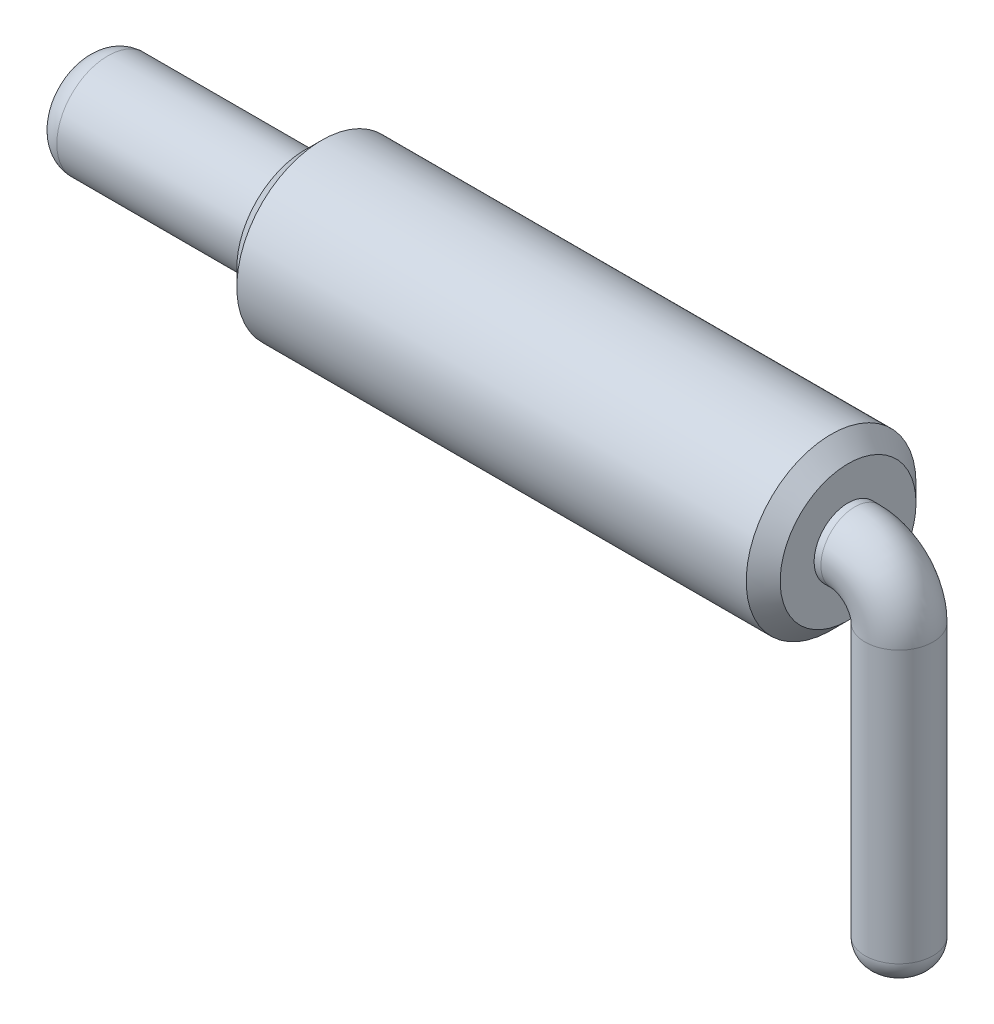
ISO-10303-21;
HEADER;
FILE_DESCRIPTION(('STEP AP214'),'2;1');
FILE_NAME('part.step','',(''),(''),'','','');
FILE_SCHEMA(('AUTOMOTIVE_DESIGN { 1 0 10303 214 1 1 1 1 }'));
ENDSEC;
DATA;
#1=APPLICATION_CONTEXT('core data for automotive mechanical design processes');
#2=APPLICATION_PROTOCOL_DEFINITION('international standard','automotive_design',2000,#1);
#3=PRODUCT_CONTEXT('',#1,'mechanical');
#4=PRODUCT('Part','Part','',(#3));
#5=PRODUCT_RELATED_PRODUCT_CATEGORY('part','',(#4));
#6=PRODUCT_DEFINITION_FORMATION('','',#4);
#7=PRODUCT_DEFINITION_CONTEXT('part definition',#1,'design');
#8=PRODUCT_DEFINITION('design','',#6,#7);
#9=PRODUCT_DEFINITION_SHAPE('','',#8);
#10=(LENGTH_UNIT() NAMED_UNIT(*) SI_UNIT(.MILLI.,.METRE.));
#11=(NAMED_UNIT(*) PLANE_ANGLE_UNIT() SI_UNIT($,.RADIAN.));
#12=(NAMED_UNIT(*) SI_UNIT($,.STERADIAN.) SOLID_ANGLE_UNIT());
#13=UNCERTAINTY_MEASURE_WITH_UNIT(LENGTH_MEASURE(1.E-05),#10,'distance_accuracy_value','');
#14=(GEOMETRIC_REPRESENTATION_CONTEXT(3) GLOBAL_UNCERTAINTY_ASSIGNED_CONTEXT((#13)) GLOBAL_UNIT_ASSIGNED_CONTEXT((#10,
#11,#12)) REPRESENTATION_CONTEXT('',''));
#15=CARTESIAN_POINT('',(0.,0.,0.));
#16=DIRECTION('',(0.,0.,1.));
#17=DIRECTION('',(1.,0.,0.));
#18=AXIS2_PLACEMENT_3D('',#15,#16,#17);
#19=CARTESIAN_POINT('',(16.,0.,0.));
#20=DIRECTION('',(1.,0.,0.));
#21=DIRECTION('',(0.,0.,-1.));
#22=AXIS2_PLACEMENT_3D('',#19,#20,#21);
#23=PLANE('',#22);
#24=CARTESIAN_POINT('',(16.,0.,0.));
#25=DIRECTION('',(1.,0.,0.));
#26=DIRECTION('',(0.,0.,-1.));
#27=AXIS2_PLACEMENT_3D('',#24,#25,#26);
#28=CIRCLE('',#27,1.99999999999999);
#29=CARTESIAN_POINT('',(16.,0.,-1.99999999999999));
#30=VERTEX_POINT('',#29);
#31=EDGE_CURVE('E61',#30,#30,#28,.T.);
#32=ORIENTED_EDGE('',*,*,#31,.T.);
#33=EDGE_LOOP('',(#32));
#34=FACE_BOUND('',#33,.T.);
#35=CARTESIAN_POINT('',(16.,0.,0.));
#36=DIRECTION('',(1.,0.,0.));
#37=DIRECTION('',(0.,1.,0.));
#38=AXIS2_PLACEMENT_3D('',#35,#36,#37);
#39=CIRCLE('',#38,1.);
#40=CARTESIAN_POINT('',(16.,1.,0.));
#41=VERTEX_POINT('',#40);
#42=EDGE_CURVE('E67',#41,#41,#39,.T.);
#43=ORIENTED_EDGE('',*,*,#42,.F.);
#44=EDGE_LOOP('',(#43));
#45=FACE_BOUND('',#44,.T.);
#46=ADVANCED_FACE('F32',(#34,#45),#23,.T.);
#47=CARTESIAN_POINT('',(0.,0.,0.));
#48=DIRECTION('',(1.,0.,0.));
#49=DIRECTION('',(0.,0.,-1.));
#50=AXIS2_PLACEMENT_3D('',#47,#48,#49);
#51=PLANE('',#50);
#52=CARTESIAN_POINT('',(0.,0.,0.));
#53=DIRECTION('',(1.,0.,0.));
#54=DIRECTION('',(0.,0.,-1.));
#55=AXIS2_PLACEMENT_3D('',#52,#53,#54);
#56=CIRCLE('',#55,2.);
#57=CARTESIAN_POINT('',(0.,0.,-2.));
#58=VERTEX_POINT('',#57);
#59=EDGE_CURVE('E52',#58,#58,#56,.F.);
#60=ORIENTED_EDGE('',*,*,#59,.T.);
#61=EDGE_LOOP('',(#60));
#62=FACE_BOUND('',#61,.T.);
#63=CARTESIAN_POINT('',(0.,0.,0.));
#64=DIRECTION('',(1.,0.,0.));
#65=DIRECTION('',(0.,0.,-1.));
#66=AXIS2_PLACEMENT_3D('',#63,#64,#65);
#67=CIRCLE('',#66,1.5);
#68=CARTESIAN_POINT('',(0.,0.,-1.5));
#69=VERTEX_POINT('',#68);
#70=EDGE_CURVE('E64',#69,#69,#67,.F.);
#71=ORIENTED_EDGE('',*,*,#70,.F.);
#72=EDGE_LOOP('',(#71));
#73=FACE_BOUND('',#72,.T.);
#74=ADVANCED_FACE('F93',(#62,#73),#51,.F.);
#75=CARTESIAN_POINT('',(16.,0.,0.));
#76=DIRECTION('',(-1.,0.,0.));
#77=DIRECTION('',(0.,0.,1.));
#78=AXIS2_PLACEMENT_3D('',#75,#76,#77);
#79=CYLINDRICAL_SURFACE('',#78,2.5);
#80=CARTESIAN_POINT('',(15.5,0.,0.));
#81=DIRECTION('',(1.,0.,0.));
#82=DIRECTION('',(0.,0.,-1.));
#83=AXIS2_PLACEMENT_3D('',#80,#81,#82);
#84=CIRCLE('',#83,2.5);
#85=CARTESIAN_POINT('',(15.5,0.,-2.5));
#86=VERTEX_POINT('',#85);
#87=EDGE_CURVE('E55',#86,#86,#84,.F.);
#88=ORIENTED_EDGE('',*,*,#87,.T.);
#89=EDGE_LOOP('',(#88));
#90=FACE_BOUND('',#89,.T.);
#91=CARTESIAN_POINT('',(0.5,0.,0.));
#92=DIRECTION('',(1.,0.,0.));
#93=DIRECTION('',(0.,0.,-1.));
#94=AXIS2_PLACEMENT_3D('',#91,#92,#93);
#95=CIRCLE('',#94,2.5);
#96=CARTESIAN_POINT('',(0.5,0.,-2.5));
#97=VERTEX_POINT('',#96);
#98=EDGE_CURVE('E58',#97,#97,#95,.T.);
#99=ORIENTED_EDGE('',*,*,#98,.T.);
#100=EDGE_LOOP('',(#99));
#101=FACE_BOUND('',#100,.T.);
#102=ADVANCED_FACE('F99',(#90,#101),#79,.T.);
#103=CARTESIAN_POINT('',(-6.5,0.,0.));
#104=DIRECTION('',(1.,0.,0.));
#105=DIRECTION('',(0.,0.,-1.));
#106=AXIS2_PLACEMENT_3D('',#103,#104,#105);
#107=CYLINDRICAL_SURFACE('',#106,1.5);
#108=CARTESIAN_POINT('',(-5.8,0.,0.));
#109=DIRECTION('',(-1.,0.,0.));
#110=DIRECTION('',(0.,0.,1.));
#111=AXIS2_PLACEMENT_3D('',#108,#109,#110);
#112=CIRCLE('',#111,1.5);
#113=CARTESIAN_POINT('',(-5.8,0.,-1.5));
#114=VERTEX_POINT('',#113);
#115=EDGE_CURVE('E10',#114,#114,#112,.F.);
#116=CARTESIAN_POINT('',(-5.8,0.,-1.5));
#117=CARTESIAN_POINT('',(-5.73958333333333,0.,-1.5));
#118=CARTESIAN_POINT('',(-5.67916666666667,0.,-1.5));
#119=CARTESIAN_POINT('',(-5.55833333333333,0.,-1.5));
#120=CARTESIAN_POINT('',(-5.49791666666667,0.,-1.5));
#121=CARTESIAN_POINT('',(-5.37708333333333,0.,-1.5));
#122=CARTESIAN_POINT('',(-5.31666666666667,0.,-1.5));
#123=CARTESIAN_POINT('',(-5.19583333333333,0.,-1.5));
#124=CARTESIAN_POINT('',(-5.13541666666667,0.,-1.5));
#125=CARTESIAN_POINT('',(-5.01458333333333,0.,-1.5));
#126=CARTESIAN_POINT('',(-4.95416666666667,0.,-1.5));
#127=CARTESIAN_POINT('',(-4.83333333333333,0.,-1.5));
#128=CARTESIAN_POINT('',(-4.77291666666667,0.,-1.5));
#129=CARTESIAN_POINT('',(-4.65208333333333,0.,-1.5));
#130=CARTESIAN_POINT('',(-4.59166666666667,0.,-1.5));
#131=CARTESIAN_POINT('',(-4.47083333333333,0.,-1.5));
#132=CARTESIAN_POINT('',(-4.41041666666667,0.,-1.5));
#133=CARTESIAN_POINT('',(-4.28958333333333,0.,-1.5));
#134=CARTESIAN_POINT('',(-4.22916666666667,0.,-1.5));
#135=CARTESIAN_POINT('',(-4.10833333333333,0.,-1.5));
#136=CARTESIAN_POINT('',(-4.04791666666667,0.,-1.5));
#137=CARTESIAN_POINT('',(-3.92708333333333,0.,-1.5));
#138=CARTESIAN_POINT('',(-3.86666666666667,0.,-1.5));
#139=CARTESIAN_POINT('',(-3.74583333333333,0.,-1.5));
#140=CARTESIAN_POINT('',(-3.68541666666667,0.,-1.5));
#141=CARTESIAN_POINT('',(-3.56458333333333,0.,-1.5));
#142=CARTESIAN_POINT('',(-3.50416666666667,0.,-1.5));
#143=CARTESIAN_POINT('',(-3.38333333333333,0.,-1.5));
#144=CARTESIAN_POINT('',(-3.32291666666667,0.,-1.5));
#145=CARTESIAN_POINT('',(-3.20208333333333,0.,-1.5));
#146=CARTESIAN_POINT('',(-3.14166666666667,0.,-1.5));
#147=CARTESIAN_POINT('',(-3.02083333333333,0.,-1.5));
#148=CARTESIAN_POINT('',(-2.96041666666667,0.,-1.5));
#149=CARTESIAN_POINT('',(-2.83958333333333,0.,-1.5));
#150=CARTESIAN_POINT('',(-2.77916666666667,0.,-1.5));
#151=CARTESIAN_POINT('',(-2.65833333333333,0.,-1.5));
#152=CARTESIAN_POINT('',(-2.59791666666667,0.,-1.5));
#153=CARTESIAN_POINT('',(-2.47708333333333,0.,-1.5));
#154=CARTESIAN_POINT('',(-2.41666666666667,0.,-1.5));
#155=CARTESIAN_POINT('',(-2.29583333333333,0.,-1.5));
#156=CARTESIAN_POINT('',(-2.23541666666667,0.,-1.5));
#157=CARTESIAN_POINT('',(-2.11458333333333,0.,-1.5));
#158=CARTESIAN_POINT('',(-2.05416666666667,0.,-1.5));
#159=CARTESIAN_POINT('',(-1.93333333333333,0.,-1.5));
#160=CARTESIAN_POINT('',(-1.87291666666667,0.,-1.5));
#161=CARTESIAN_POINT('',(-1.75208333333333,0.,-1.5));
#162=CARTESIAN_POINT('',(-1.69166666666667,0.,-1.5));
#163=CARTESIAN_POINT('',(-1.57083333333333,0.,-1.5));
#164=CARTESIAN_POINT('',(-1.51041666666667,0.,-1.5));
#165=CARTESIAN_POINT('',(-1.38958333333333,0.,-1.5));
#166=CARTESIAN_POINT('',(-1.32916666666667,0.,-1.5));
#167=CARTESIAN_POINT('',(-1.20833333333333,0.,-1.5));
#168=CARTESIAN_POINT('',(-1.14791666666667,0.,-1.5));
#169=CARTESIAN_POINT('',(-1.02708333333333,0.,-1.5));
#170=CARTESIAN_POINT('',(-0.966666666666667,0.,-1.5));
#171=CARTESIAN_POINT('',(-0.845833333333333,0.,-1.5));
#172=CARTESIAN_POINT('',(-0.785416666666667,0.,-1.5));
#173=CARTESIAN_POINT('',(-0.664583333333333,0.,-1.5));
#174=CARTESIAN_POINT('',(-0.604166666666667,0.,-1.5));
#175=CARTESIAN_POINT('',(-0.483333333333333,0.,-1.5));
#176=CARTESIAN_POINT('',(-0.422916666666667,0.,-1.5));
#177=CARTESIAN_POINT('',(-0.302083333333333,0.,-1.5));
#178=CARTESIAN_POINT('',(-0.241666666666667,0.,-1.5));
#179=CARTESIAN_POINT('',(-0.120833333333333,0.,-1.5));
#180=CARTESIAN_POINT('',(-0.0604166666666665,0.,-1.5));
#181=CARTESIAN_POINT('',(0.,0.,-1.5));
#182=B_SPLINE_CURVE_WITH_KNOTS('',3,(#116,#117,#118,#119,#120,#121,#122,#123,#124,#125,#126,
#127,#128,#129,#130,#131,#132,#133,#134,#135,#136,#137,#138,#139,#140,#141,#142,#143,#144,#145,
#146,#147,#148,#149,#150,#151,#152,#153,#154,#155,#156,#157,#158,#159,#160,#161,#162,#163,#164,
#165,#166,#167,#168,#169,#170,#171,#172,#173,#174,#175,#176,#177,#178,#179,#180,#181),
.UNSPECIFIED.,.F.,.F.,(4,2,2,2,2,2,2,2,2,2,2,2,2,2,2,2,2,2,2,2,2,2,2,2,2,2,2,2,2,2,2,2,4),(0.,
0.18125,0.362499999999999,0.54375,0.724999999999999,0.90625,1.0875,1.26875,1.45,1.63125,1.8125,
1.99375,2.175,2.35625,2.5375,2.71875,2.9,3.08125,3.2625,3.44375,3.625,3.80625,3.9875,4.16875,
4.35,4.53125,4.7125,4.89375,5.075,5.25625,5.4375,5.61875,5.8),.UNSPECIFIED.);
#183=EDGE_CURVE('BSEAM103',#114,#69,#182,.T.);
#184=ORIENTED_EDGE('',*,*,#115,.T.);
#185=ORIENTED_EDGE('',*,*,#70,.T.);
#186=ORIENTED_EDGE('',*,*,#183,.T.);
#187=ORIENTED_EDGE('',*,*,#183,.F.);
#188=EDGE_LOOP('',(#184,#186,#185,#187));
#189=FACE_BOUND('',#188,.T.);
#190=ADVANCED_FACE('F103',(#189),#107,.T.);
#191=CARTESIAN_POINT('',(-6.5,0.,0.));
#192=DIRECTION('',(-1.,0.,0.));
#193=DIRECTION('',(0.,0.,1.));
#194=AXIS2_PLACEMENT_3D('',#191,#192,#193);
#195=PLANE('',#194);
#196=CARTESIAN_POINT('',(-6.5,0.,0.));
#197=DIRECTION('',(-1.,0.,0.));
#198=DIRECTION('',(0.,0.,1.));
#199=AXIS2_PLACEMENT_3D('',#196,#197,#198);
#200=CIRCLE('',#199,0.8);
#201=CARTESIAN_POINT('',(-6.5,0.,0.8));
#202=VERTEX_POINT('',#201);
#203=EDGE_CURVE('E39',#202,#202,#200,.T.);
#204=ORIENTED_EDGE('',*,*,#203,.T.);
#205=EDGE_LOOP('',(#204));
#206=FACE_BOUND('',#205,.T.);
#207=ADVANCED_FACE('F88',(#206),#195,.T.);
#208=CARTESIAN_POINT('',(16.2,0.,0.));
#209=DIRECTION('',(-1.,0.,0.));
#210=DIRECTION('',(0.,-1.,0.));
#211=AXIS2_PLACEMENT_3D('',#208,#209,#210);
#212=CYLINDRICAL_SURFACE('',#211,1.);
#213=CARTESIAN_POINT('',(16.2,0.,0.));
#214=DIRECTION('',(1.,0.,0.));
#215=DIRECTION('',(0.,1.,0.));
#216=AXIS2_PLACEMENT_3D('',#213,#214,#215);
#217=CIRCLE('',#216,1.);
#218=CARTESIAN_POINT('',(16.2,1.,0.));
#219=VERTEX_POINT('',#218);
#220=EDGE_CURVE('E70',#219,#219,#217,.T.);
#221=ORIENTED_EDGE('',*,*,#220,.F.);
#222=EDGE_LOOP('',(#221));
#223=FACE_BOUND('',#222,.T.);
#224=ORIENTED_EDGE('',*,*,#42,.T.);
#225=EDGE_LOOP('',(#224));
#226=FACE_BOUND('',#225,.T.);
#227=ADVANCED_FACE('F82',(#223,#226),#212,.T.);
#228=CARTESIAN_POINT('',(16.2,-1.3,0.));
#229=DIRECTION('',(0.,0.,1.));
#230=DIRECTION('',(1.,0.,0.));
#231=AXIS2_PLACEMENT_3D('',#228,#229,#230);
#232=TOROIDAL_SURFACE('',#231,1.3,1.);
#233=CARTESIAN_POINT('',(17.5,-1.3,0.));
#234=DIRECTION('',(0.,-1.,0.));
#235=DIRECTION('',(1.,0.,0.));
#236=AXIS2_PLACEMENT_3D('',#233,#234,#235);
#237=CIRCLE('',#236,1.);
#238=CARTESIAN_POINT('',(18.5,-1.3,0.));
#239=VERTEX_POINT('',#238);
#240=EDGE_CURVE('E73',#239,#239,#237,.T.);
#241=CARTESIAN_POINT('',(16.2,-1.3,0.));
#242=DIRECTION('',(0.,0.,1.));
#243=DIRECTION('',(1.,0.,0.));
#244=AXIS2_PLACEMENT_3D('',#241,#242,#243);
#245=CIRCLE('',#244,2.3);
#246=EDGE_CURVE('',#239,#219,#245,.T.);
#247=ORIENTED_EDGE('',*,*,#240,.F.);
#248=ORIENTED_EDGE('',*,*,#220,.T.);
#249=ORIENTED_EDGE('',*,*,#246,.T.);
#250=ORIENTED_EDGE('',*,*,#246,.F.);
#251=EDGE_LOOP('',(#247,#249,#248,#250));
#252=FACE_BOUND('',#251,.T.);
#253=ADVANCED_FACE('F79',(#252),#232,.T.);
#254=CARTESIAN_POINT('',(17.5,-1.3,0.));
#255=DIRECTION('',(0.,-1.,0.));
#256=DIRECTION('',(1.,0.,0.));
#257=AXIS2_PLACEMENT_3D('',#254,#255,#256);
#258=CYLINDRICAL_SURFACE('',#257,1.);
#259=CARTESIAN_POINT('',(17.5,-9.3,0.));
#260=DIRECTION('',(0.,-1.,0.));
#261=DIRECTION('',(1.,0.,0.));
#262=AXIS2_PLACEMENT_3D('',#259,#260,#261);
#263=CIRCLE('',#262,1.);
#264=CARTESIAN_POINT('',(18.5,-9.3,0.));
#265=VERTEX_POINT('',#264);
#266=EDGE_CURVE('E43',#265,#265,#263,.F.);
#267=ORIENTED_EDGE('',*,*,#266,.T.);
#268=EDGE_LOOP('',(#267));
#269=FACE_BOUND('',#268,.T.);
#270=ORIENTED_EDGE('',*,*,#240,.T.);
#271=EDGE_LOOP('',(#270));
#272=FACE_BOUND('',#271,.T.);
#273=ADVANCED_FACE('F77',(#269,#272),#258,.T.);
#274=CARTESIAN_POINT('',(17.5,-10.,0.));
#275=DIRECTION('',(0.,-1.,0.));
#276=DIRECTION('',(1.,0.,0.));
#277=AXIS2_PLACEMENT_3D('',#274,#275,#276);
#278=PLANE('',#277);
#279=CARTESIAN_POINT('',(17.5,-10.,0.));
#280=DIRECTION('',(0.,-1.,0.));
#281=DIRECTION('',(1.,0.,0.));
#282=AXIS2_PLACEMENT_3D('',#279,#280,#281);
#283=CIRCLE('',#282,0.300000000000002);
#284=CARTESIAN_POINT('',(17.8,-10.,0.));
#285=VERTEX_POINT('',#284);
#286=EDGE_CURVE('E47',#285,#285,#283,.T.);
#287=ORIENTED_EDGE('',*,*,#286,.T.);
#288=EDGE_LOOP('',(#287));
#289=FACE_BOUND('',#288,.T.);
#290=ADVANCED_FACE('F113',(#289),#278,.T.);
#291=CARTESIAN_POINT('',(16.,0.,0.));
#292=DIRECTION('',(-1.,0.,0.));
#293=DIRECTION('',(0.,0.,1.));
#294=AXIS2_PLACEMENT_3D('',#291,#292,#293);
#295=CONICAL_SURFACE('',#294,1.99999999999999,0.785398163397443);
#296=ORIENTED_EDGE('',*,*,#87,.F.);
#297=EDGE_LOOP('',(#296));
#298=FACE_BOUND('',#297,.T.);
#299=ORIENTED_EDGE('',*,*,#31,.F.);
#300=EDGE_LOOP('',(#299));
#301=FACE_BOUND('',#300,.T.);
#302=ADVANCED_FACE('F109',(#298,#301),#295,.T.);
#303=CARTESIAN_POINT('',(0.5,0.,0.));
#304=DIRECTION('',(1.,0.,0.));
#305=DIRECTION('',(0.,0.,-1.));
#306=AXIS2_PLACEMENT_3D('',#303,#304,#305);
#307=CONICAL_SURFACE('',#306,2.5,0.78539816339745);
#308=ORIENTED_EDGE('',*,*,#59,.F.);
#309=EDGE_LOOP('',(#308));
#310=FACE_BOUND('',#309,.T.);
#311=ORIENTED_EDGE('',*,*,#98,.F.);
#312=EDGE_LOOP('',(#311));
#313=FACE_BOUND('',#312,.T.);
#314=ADVANCED_FACE('F112',(#310,#313),#307,.T.);
#315=CARTESIAN_POINT('',(17.5,-9.3,0.));
#316=DIRECTION('',(0.,-1.,0.));
#317=DIRECTION('',(1.,0.,0.));
#318=AXIS2_PLACEMENT_3D('',#315,#316,#317);
#319=DEGENERATE_TOROIDAL_SURFACE('',#318,0.300000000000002,0.7,.T.);
#320=ORIENTED_EDGE('',*,*,#266,.F.);
#321=EDGE_LOOP('',(#320));
#322=FACE_BOUND('',#321,.T.);
#323=ORIENTED_EDGE('',*,*,#286,.F.);
#324=EDGE_LOOP('',(#323));
#325=FACE_BOUND('',#324,.T.);
#326=ADVANCED_FACE('F116',(#322,#325),#319,.T.);
#327=CARTESIAN_POINT('',(-5.8,0.,0.));
#328=DIRECTION('',(-1.,0.,0.));
#329=DIRECTION('',(0.,0.,1.));
#330=AXIS2_PLACEMENT_3D('',#327,#328,#329);
#331=TOROIDAL_SURFACE('',#330,0.8,0.7);
#332=ORIENTED_EDGE('',*,*,#115,.F.);
#333=EDGE_LOOP('',(#332));
#334=FACE_BOUND('',#333,.T.);
#335=ORIENTED_EDGE('',*,*,#203,.F.);
#336=EDGE_LOOP('',(#335));
#337=FACE_BOUND('',#336,.T.);
#338=ADVANCED_FACE('F34',(#334,#337),#331,.T.);
#339=CLOSED_SHELL('',(#46,#74,#102,#190,#207,#227,#253,#273,#290,#302,#314,#326,#338));
#340=MANIFOLD_SOLID_BREP('B2',#339);
#341=ADVANCED_BREP_SHAPE_REPRESENTATION('',(#18,#340),#14);
#342=SHAPE_DEFINITION_REPRESENTATION(#9,#341);
ENDSEC;
END-ISO-10303-21;
